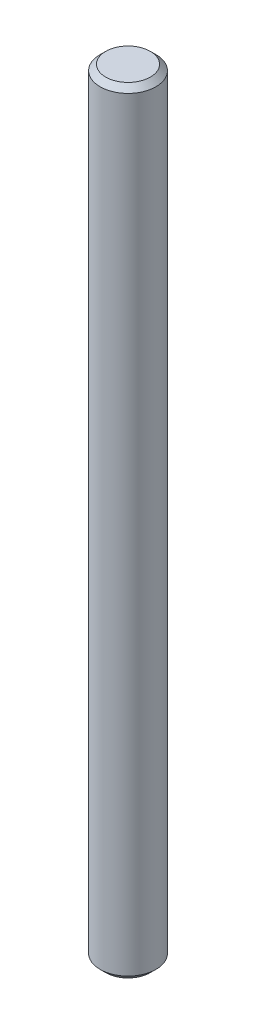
from build123d import *

# Parameters (mm, degrees)
SKETCH1_R           = 5
BOSS_EXTRUDE1_DEPTH = 69.5
CHAMFER1_SIZE       = 1


with BuildPart() as part:
    # Sketch1 → Boss-Extrude1 (new, symmetric)
    with BuildSketch(Plane(origin=(0, 0, 0), x_dir=(1, 0, 0), z_dir=(0, 1, 0))):
        with Locations(Location((0, 0, 0), (0, 0, 270))):
            Circle(SKETCH1_R)
    extrude(amount=BOSS_EXTRUDE1_DEPTH, both=True)

    # Chamfer1
    chamfer1_edges = [part.edges().sort_by_distance(p)[0] for p in [
        (0, -69.5, -5),
        (0, 69.5, -5),
    ]]
    chamfer(chamfer1_edges, length=CHAMFER1_SIZE)


solid = part.part
